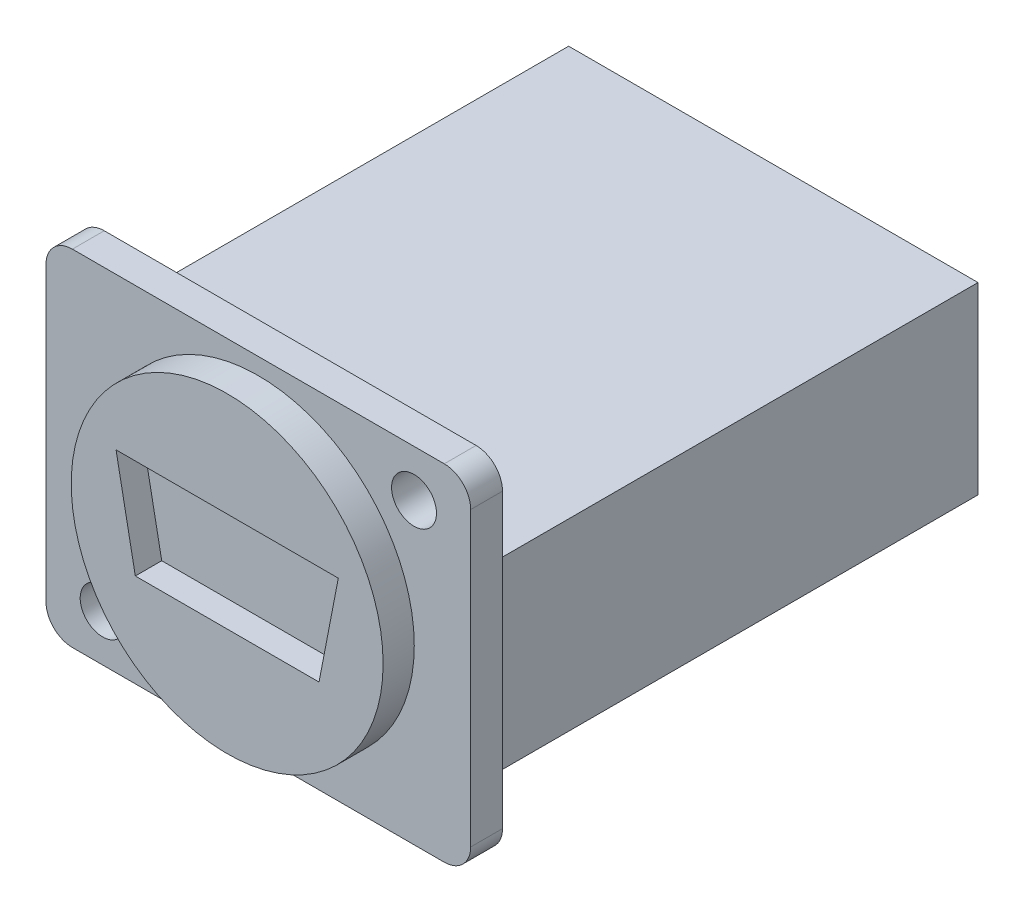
from build123d import *

# Parameters (mm, degrees)
EXTRUDE_1_DEPTH     = 2.41
SKETCH_2_R          = 11.81
EXTRUDE_2_DEPTH     = 2.36
SKETCH_3_R          = 1.7
CUT_EXTRUDE_1_DEPTH = 21.858301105
CUT_EXTRUDE_2_DEPTH = 2
SKETCH_5_W          = 31
SKETCH_5_H          = 13.93
EXTRUDE_3_DEPTH     = 36.59


with BuildPart() as part:
    # Sketch 1 → Extrude 1 (new body)
    with BuildSketch(Plane.XY):
        with BuildLine():
            Line((-14.08, 13.065), (14.08, 13.065))
            ThreePointArc((14.08, 13.065), (15.494213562, 12.479213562), (16.08, 11.065))
            Line((16.08, 11.065), (16.08, -11.065))
            ThreePointArc((16.08, -11.065), (15.494213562, -12.479213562), (14.08, -13.065))
            Line((14.08, -13.065), (-14.08, -13.065))
            ThreePointArc((-14.08, -13.065), (-15.494213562, -12.479213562), (-16.08, -11.065))
            Line((-16.08, -11.065), (-16.08, 11.065))
            ThreePointArc((-16.08, 11.065), (-15.494213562, 12.479213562), (-14.08, 13.065))
        make_face()
    extrude(amount=EXTRUDE_1_DEPTH)

    # Sketch 2 → Extrude 2 (add)
    with BuildSketch(Plane.XY.offset(2.41)):
        Circle(SKETCH_2_R)
    extrude(amount=EXTRUDE_2_DEPTH)

    # Sketch 3 → Cut-Extrude 1 (cut, through all)
    with BuildSketch(Plane.XY.offset(2.41)):
        with Locations((11.79, 9.525)):
            Circle(SKETCH_3_R)
        with Locations((-11.79, -9.525)):
            Circle(SKETCH_3_R)
    extrude(amount=-CUT_EXTRUDE_1_DEPTH, mode=Mode.SUBTRACT)

    # Sketch 4 → Cut-Extrude 2 (cut)
    with BuildSketch(Plane.XY.offset(4.77)):
        Polygon((-8.415908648, 3.913904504), (8.415908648, 3.913904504), (6.955799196, -3.629994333), (-6.955799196, -3.629994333), align=None)
    extrude(amount=-CUT_EXTRUDE_2_DEPTH, mode=Mode.SUBTRACT)

    # Sketch 5 → Extrude 3 (add)
    with BuildSketch(Plane(origin=(0, 0, 0), x_dir=(-1, 0, 0), z_dir=(0, 0, -1))):
        with Locations((0, -0.8)):
            Rectangle(SKETCH_5_W, SKETCH_5_H)
    extrude(amount=EXTRUDE_3_DEPTH)


solid = part.part
